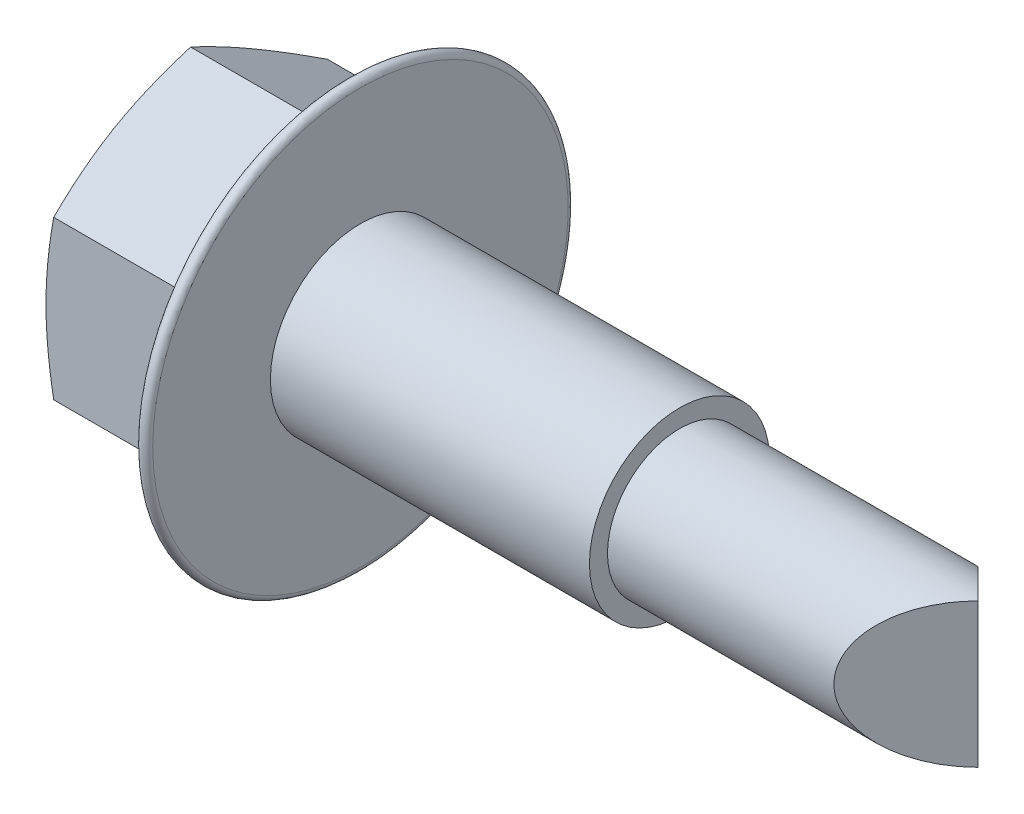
from build123d import *

# Parameters (mm, degrees)
CUT_EXTRUDE1_DEPTH      = 13.252550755
CUT_EXTRUDE1_DEPTH_BACK = 13.252550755
BASEHEAD_DEPTH          = 3.45
FILLET2_R               = 0.2
SKETCH7_W               = 0.43125
SKETCH7_H               = 2.216666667


with BuildPart() as part:
    # Sketch1 → BaseBody (revolve)
    with BuildSketch(Plane.XY, mode=Mode.PRIVATE) as basebody_sk:
        Polygon((0, 0), (0, 1.75), (6.2, 1.75), (6.2, 1.4), (12, 1.4), (12, 0), align=None)
    revolve(basebody_sk.sketch.rotate(Axis((-5.816971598, 0, 0), (1, 0, 0)), 90), axis=Axis((-5.816971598, 0, 0), (1, 0, 0)))

    # Sketch2 → Cut-Extrude1 (cut, two sides: drawn at the far end of the back side and taken through both)
    with BuildSketch(Plane(origin=(0, 0, 0), x_dir=(1, 0, 0), z_dir=(0, 1, 0)).offset(-CUT_EXTRUDE1_DEPTH_BACK)):
        Polygon((12.45645435, -10), (12.45645435, 10), (2, 10), (12, 0), (2, -10), align=None)
    extrude(amount=CUT_EXTRUDE1_DEPTH + CUT_EXTRUDE1_DEPTH_BACK, mode=Mode.SUBTRACT)

    # Sketch3 → BaseHead (add)
    with BuildSketch(Plane(origin=(0, 0, 0), x_dir=(0, 0, -1), z_dir=(1, 0, 0))):
        Polygon((0, -3.071503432), (2.66, -1.535751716), (2.66, 1.535751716), (0, 3.071503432), (-2.66, 1.535751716), (-2.66, -1.535751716), align=None)
    extrude(amount=-BASEHEAD_DEPTH)

    # Sketch4 → Cut-Revolve1 (revolve, cut)
    with BuildSketch(Plane(origin=(0, 0, 0), x_dir=(1, 0, 0), z_dir=(0, 1, 0))):
        Polygon((-3.45, 15), (-3.45, 2.66), (1.041392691, 15), align=None)
    revolve(axis=Axis((0, 0, 0), (-1, 0, 0)), mode=Mode.SUBTRACT)

    # Sketch5 → Revolve2 (revolve)
    with BuildSketch(Plane(origin=(0, 0, 0), x_dir=(1, 0, 0), z_dir=(0, 1, 0)), mode=Mode.PRIVATE) as revolve2_sk:
        with BuildLine():
            Line((0, 0), (0, 4.036407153))
            ThreePointArc((0, 4.036407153), (-0.098766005, 4.149028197), (-0.223315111, 4.065807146))
            Line((-0.223315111, 4.065807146), (-1.312744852, 0))
            Line((-1.312744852, 0), (0, 0))
        make_face()
    revolve(revolve2_sk.sketch.rotate(Axis((-28.724417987, 0, 0), (1, 0, 0)), 180), axis=Axis((-28.724417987, 0, 0), (1, 0, 0)))

    # Fillet2
    fillet2_edges = [part.edges().sort_by_distance(p)[0] for p in [
        (-0.570760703, -0.769701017, 2.66),
        (-0.6, -2.303627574, 1.33),
        (-0.6, -2.303627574, -1.33),
        (-0.6, 0, -2.66),
        (-0.6, 2.303627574, -1.33),
        (-0.6, 2.303627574, 1.33),
        (-0.570760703, 0.769701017, 2.66),
    ]]
    fillet(fillet2_edges, radius=FILLET2_R)

    # Sketch7 → Cut-Revolve11 (revolve, cut)
    with BuildSketch(Plane(origin=(0, 0, 0), x_dir=(1, 0, 0), z_dir=(0, 1, 0)), mode=Mode.PRIVATE) as cut_revolve11_sk:
        with Locations((-3.234375, 1.108333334)):
            Rectangle(SKETCH7_W, SKETCH7_H)
    revolve(cut_revolve11_sk.sketch.rotate(Axis((-3.45, 0, 0), (-1, 0, 0)), 330.000009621), axis=Axis((-3.45, 0, 0), (-1, 0, 0)), mode=Mode.SUBTRACT)


solid = part.part
